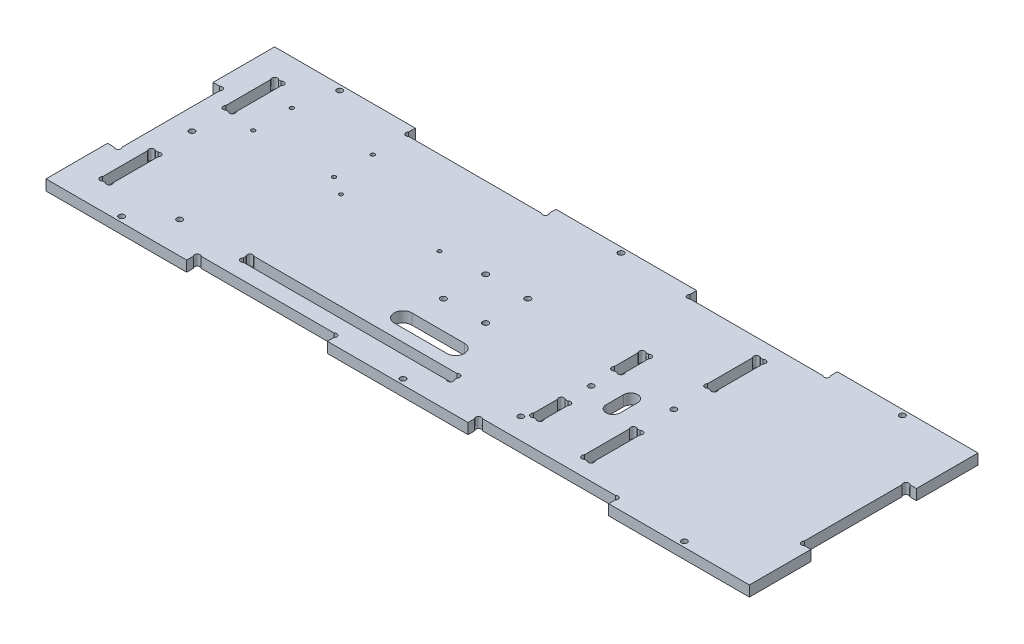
from build123d import *

# Parameters (mm, degrees)
ESQUISSE1_R             = 1.6
ESQUISSE1_R_2           = 1.65
ESQUISSE1_R_3           = 1.1
BOSS_EXTRU_1_DEPTH      = 6
ESQUISSE2_R             = 1.1
ENL_V_MAT_EXTRU_1_DEPTH = 1


with BuildPart() as part:
    # Esquisse1 → Boss.-Extru.1 (new body)
    with BuildSketch(Plane(origin=(0, 0, 0), x_dir=(1, 0, 0), z_dir=(0, 1, 0))):
        with BuildLine():
            Line((-200, 65), (-120, 65))
            Line((-120, 65), (-120, 61.2627417))
            ThreePointArc((-120, 61.2627417), (-120, 59), (-117.7372583, 59))
            Line((-117.7372583, 59), (-42.2627417, 59))
            ThreePointArc((-42.2627417, 59), (-40, 59), (-40, 61.2627417))
            Line((-40, 61.2627417), (-40, 65))
            Line((-40, 65), (40, 65))
            Line((40, 65), (40, 61.2627417))
            ThreePointArc((40, 61.2627417), (40, 59), (42.2627417, 59))
            Line((42.2627417, 59), (117.7372583, 59))
            ThreePointArc((117.7372583, 59), (120, 59), (120, 61.2627417))
            Line((120, 61.2627417), (120, 65))
            Line((120, 65), (200, 65))
            Line((200, 65), (200, 30))
            Line((200, 30), (196.2627417, 30))
            ThreePointArc((196.2627417, 30), (194, 30), (194, 27.7372583))
            Line((194, 27.7372583), (194, -27.7372583))
            ThreePointArc((194, -27.7372583), (194, -30), (196.2627417, -30))
            Line((196.2627417, -30), (200, -30))
            Line((200, -30), (200, -65))
            Line((200, -65), (120, -65))
            Line((120, -65), (120, -61.2627417))
            ThreePointArc((120, -61.2627417), (120, -59), (117.7372583, -59))
            Line((117.7372583, -59), (42.2627417, -59))
            ThreePointArc((42.2627417, -59), (40, -59), (40, -61.2627417))
            Line((40, -61.2627417), (40, -65))
            Line((40, -65), (-40, -65))
            Line((-40, -65), (-40, -61.2627417))
            ThreePointArc((-40, -61.2627417), (-40, -59), (-42.2627417, -59))
            Line((-42.2627417, -59), (-117.7372583, -59))
            ThreePointArc((-117.7372583, -59), (-120, -59), (-120, -61.2627417))
            Line((-120, -61.2627417), (-120, -65))
            Line((-120, -65), (-200, -65))
            Line((-200, -65), (-200, -30))
            Line((-200, -30), (-196.2627417, -30))
            ThreePointArc((-196.2627417, -30), (-194, -30), (-194, -27.7372583))
            Line((-194, -27.7372583), (-194, 27.7372583))
            ThreePointArc((-194, 27.7372583), (-194, 30), (-196.2627417, 30))
            Line((-196.2627417, 30), (-200, 30))
            Line((-200, 30), (-200, 65))
        make_face()
        with Locations(Location((0, 62, 0), (0, 0, 270))):
            Circle(ESQUISSE1_R, mode=Mode.SUBTRACT)
        with Locations(Location((160, 62, 0), (0, 0, 90))):
            Circle(ESQUISSE1_R, mode=Mode.SUBTRACT)
        with Locations(Location((-160, 62, 0), (0, 0, 270))):
            Circle(ESQUISSE1_R, mode=Mode.SUBTRACT)
        with Locations(Location((0, -62, 0), (0, 0, 90))):
            Circle(ESQUISSE1_R, mode=Mode.SUBTRACT)
        with Locations(Location((160, -62, 0), (0, 0, 270))):
            Circle(ESQUISSE1_R, mode=Mode.SUBTRACT)
        with Locations(Location((-160, -62, 0), (0, 0, 90))):
            Circle(ESQUISSE1_R, mode=Mode.SUBTRACT)
        with Locations(Location((92, 0, 0), (0, 0, 270))):
            Circle(ESQUISSE1_R, mode=Mode.SUBTRACT)
        with Locations(Location((-182, 0, 0), (0, 0, 90))):
            Circle(ESQUISSE1_R, mode=Mode.SUBTRACT)
        with Locations(Location((-142, -47, 0), (0, 0, 270))):
            Circle(ESQUISSE1_R, mode=Mode.SUBTRACT)
        with Locations(Location((52, -47, 0), (0, 0, 90))):
            Circle(ESQUISSE1_R, mode=Mode.SUBTRACT)
        with Locations(Location((-28, -11, 0), (0, 0, 270))):
            Circle(ESQUISSE1_R_2, mode=Mode.SUBTRACT)
        with Locations(Location((-28, 13, 0), (0, 0, 270))):
            Circle(ESQUISSE1_R_2, mode=Mode.SUBTRACT)
        with Locations(Location((-4, 13, 0), (0, 0, 270))):
            Circle(ESQUISSE1_R_2, mode=Mode.SUBTRACT)
        with Locations(Location((-4, -11, 0), (0, 0, 270))):
            Circle(ESQUISSE1_R_2, mode=Mode.SUBTRACT)
        with Locations(Location((57, -12, 0), (0, 0, 270))):
            Circle(ESQUISSE1_R, mode=Mode.SUBTRACT)
        with Locations(Location((-165, 39.8, 0), (0, 0, 270))):
            Circle(ESQUISSE1_R_3, mode=Mode.SUBTRACT)
        with Locations(Location((-119, 39.8, 0), (0, 0, 270))):
            Circle(ESQUISSE1_R_3, mode=Mode.SUBTRACT)
        with Locations(Location((-165, 17.8, 0), (0, 0, 90))):
            Circle(ESQUISSE1_R_3, mode=Mode.SUBTRACT)
        with Locations(Location((-119, 17.8, 0), (0, 0, 90))):
            Circle(ESQUISSE1_R_3, mode=Mode.SUBTRACT)
        with Locations(Location((-52.500000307, 11.256223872, 0), (0, 0, 270))):
            Circle(ESQUISSE1_R_3, mode=Mode.SUBTRACT)
        with Locations(Location((-108.5, 11.256223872, 0), (0, 0, 270))):
            Circle(ESQUISSE1_R_3, mode=Mode.SUBTRACT)
        with BuildLine():
            Line((91.2627417, 50), (92.7372583, 50))
            ThreePointArc((92.7372583, 50), (95, 50), (95, 47.7372583))
            Line((95, 47.7372583), (95, 22.2627417))
            ThreePointArc((95, 22.2627417), (95, 20), (92.7372583, 20))
            Line((92.7372583, 20), (91.2627417, 20))
            ThreePointArc((91.2627417, 20), (89, 20), (89, 22.2627417))
            Line((89, 22.2627417), (89, 47.7372583))
            ThreePointArc((89, 47.7372583), (89, 50), (91.2627417, 50))
        make_face(mode=Mode.SUBTRACT)
        with BuildLine():
            Line((95, -47.7372583), (95, -22.2627417))
            ThreePointArc((95, -22.2627417), (95, -20), (92.7372583, -20))
            Line((92.7372583, -20), (91.2627417, -20))
            ThreePointArc((91.2627417, -20), (89, -20), (89, -22.2627417))
            Line((89, -22.2627417), (89, -47.7372583))
            ThreePointArc((89, -47.7372583), (89, -50), (91.2627417, -50))
            Line((91.2627417, -50), (92.7372583, -50))
            ThreePointArc((92.7372583, -50), (95, -50), (95, -47.7372583))
        make_face(mode=Mode.SUBTRACT)
        with BuildLine():
            Line((-181.2627417, -50), (-182.7372583, -50))
            ThreePointArc((-182.7372583, -50), (-185, -50), (-185, -47.7372583))
            Line((-185, -47.7372583), (-185, -22.2627417))
            ThreePointArc((-185, -22.2627417), (-185, -20), (-182.7372583, -20))
            Line((-182.7372583, -20), (-181.2627417, -20))
            ThreePointArc((-181.2627417, -20), (-179, -20), (-179, -22.2627417))
            Line((-179, -22.2627417), (-179, -47.7372583))
            ThreePointArc((-179, -47.7372583), (-179, -50), (-181.2627417, -50))
        make_face(mode=Mode.SUBTRACT)
        with BuildLine():
            Line((-185, 47.7372583), (-185, 22.2627417))
            ThreePointArc((-185, 22.2627417), (-185, 20), (-182.7372583, 20))
            Line((-182.7372583, 20), (-181.2627417, 20))
            ThreePointArc((-181.2627417, 20), (-179, 20), (-179, 22.2627417))
            Line((-179, 22.2627417), (-179, 47.7372583))
            ThreePointArc((-179, 47.7372583), (-179, 50), (-181.2627417, 50))
            Line((-181.2627417, 50), (-182.7372583, 50))
            ThreePointArc((-182.7372583, 50), (-185, 50), (-185, 47.7372583))
        make_face(mode=Mode.SUBTRACT)
        with BuildLine():
            Line((56.2627417, -26), (57.7372583, -26))
            ThreePointArc((57.7372583, -26), (60, -26), (60, -28.2627417))
            Line((60, -28.2627417), (60, -41.7372583))
            ThreePointArc((60, -41.7372583), (60, -44), (57.7372583, -44))
            Line((57.7372583, -44), (56.2627417, -44))
            ThreePointArc((56.2627417, -44), (54, -44), (54, -41.7372583))
            Line((54, -41.7372583), (54, -28.2627417))
            ThreePointArc((54, -28.2627417), (54, -26), (56.2627417, -26))
        make_face(mode=Mode.SUBTRACT)
        with BuildLine():
            Line((-102.7372583, -44), (12.7372583, -44))
            ThreePointArc((12.7372583, -44), (15, -44), (15, -46.2627417))
            Line((15, -46.2627417), (15, -47.7372583))
            ThreePointArc((15, -47.7372583), (15, -50), (12.7372583, -50))
            Line((12.7372583, -50), (-102.7372583, -50))
            ThreePointArc((-102.7372583, -50), (-105, -50), (-105, -47.7372583))
            Line((-105, -47.7372583), (-105, -46.2627417))
            ThreePointArc((-105, -46.2627417), (-105, -44), (-102.7372583, -44))
        make_face(mode=Mode.SUBTRACT)
        with BuildLine():
            Line((60, 4.2627417), (60, 17.7372583))
            ThreePointArc((60, 17.7372583), (60, 20), (57.7372583, 20))
            Line((57.7372583, 20), (56.2627417, 20))
            ThreePointArc((56.2627417, 20), (54, 20), (54, 17.7372583))
            Line((54, 17.7372583), (54, 4.2627417))
            ThreePointArc((54, 4.2627417), (54, 2), (56.2627417, 2))
            Line((56.2627417, 2), (57.7372583, 2))
            ThreePointArc((57.7372583, 2), (60, 2), (60, 4.2627417))
        make_face(mode=Mode.SUBTRACT)
        with BuildLine():
            Line((-30, -27), (0, -27))
            ThreePointArc((0, -27), (5, -32), (0, -37))
            Line((0, -37), (-30, -37))
            ThreePointArc((-30, -37), (-35, -32), (-30, -27))
        make_face(mode=Mode.SUBTRACT)
        with BuildLine():
            Line((70.5, -7), (70.5, -17))
            ThreePointArc((70.5, -17), (74.5, -21), (78.5, -17))
            Line((78.5, -17), (78.5, -7))
            ThreePointArc((78.5, -7), (74.5, -3), (70.5, -7))
        make_face(mode=Mode.SUBTRACT)
    extrude(amount=BOSS_EXTRU_1_DEPTH)

    # Esquisse2 → Enl_v. mat.-Extru.1 (cut)
    with BuildSketch(Plane.XZ):
        with Locations(Location((146, 27, 0), (0, 0, 270))):
            Circle(ESQUISSE2_R)
        with Locations(Location((146, 5, 0), (0, 0, 90))):
            Circle(ESQUISSE2_R)
        with Locations(Location((100, 5, 0), (0, 0, 270))):
            Circle(ESQUISSE2_R)
        with Locations(Location((100, 27, 0), (0, 0, 90))):
            Circle(ESQUISSE2_R)
        with Locations(Location((100, -5, 0), (0, 0, 90))):
            Circle(ESQUISSE2_R)
        with Locations(Location((146, -5, 0), (0, 0, 270))):
            Circle(ESQUISSE2_R)
        with Locations(Location((146, -27, 0), (0, 0, 90))):
            Circle(ESQUISSE2_R)
        with Locations(Location((100, -27, 0), (0, 0, 270))):
            Circle(ESQUISSE2_R)
        with Locations(Location((-146, 5, 0), (0, 0, 270))):
            Circle(ESQUISSE2_R)
        with Locations(Location((-100, 5, 0), (0, 0, 90))):
            Circle(ESQUISSE2_R)
        with Locations(Location((-100, 27, 0), (0, 0, 270))):
            Circle(ESQUISSE2_R)
        with Locations(Location((-146, 27, 0), (0, 0, 90))):
            Circle(ESQUISSE2_R)
    extrude(amount=-ENL_V_MAT_EXTRU_1_DEPTH, mode=Mode.SUBTRACT)


solid = part.part
